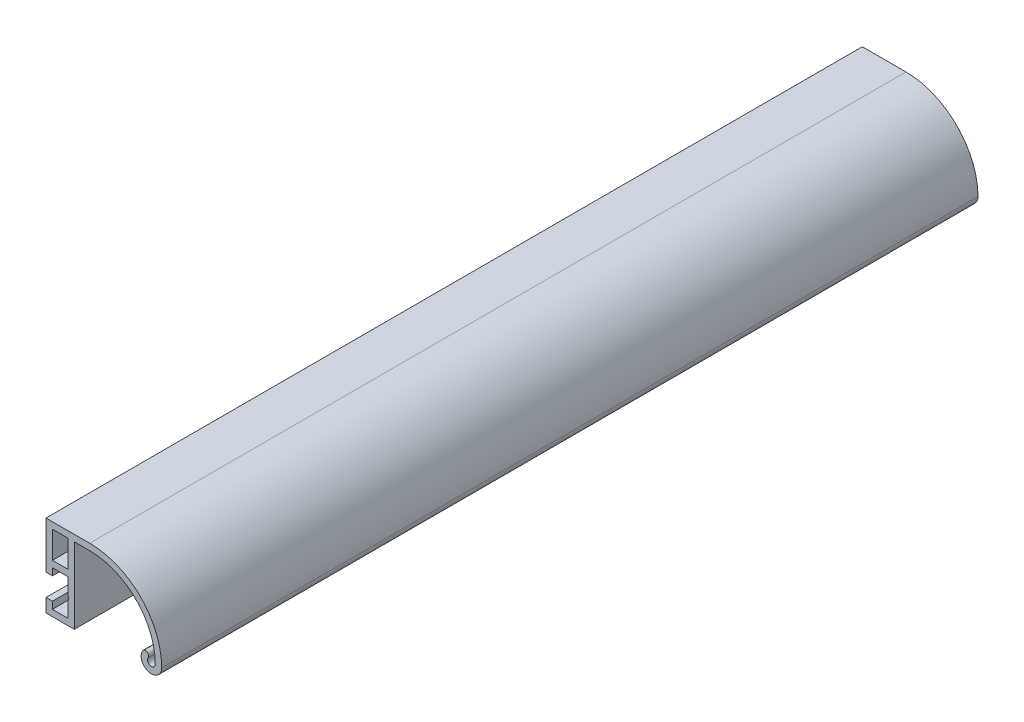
from build123d import *

# Parameters (mm, degrees)
BOSS_EXTRUDE2_DEPTH      = 158.75
BOSS_EXTRUDE2_DEPTH_BACK = 158.75
SKETCH1_W                = 6
SKETCH1_H                = 10.499998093
SKETCH2_R                = 4
CUT_EXTRUDE1_DEPTH       = 158.75


with BuildPart() as part:
    # Sketch1 → Boss-Extrude2 (new, two sides: drawn at the far end of the back side and taken through both)
    with BuildSketch(Plane.XY.offset(-BOSS_EXTRUDE2_DEPTH_BACK)):
        with BuildLine():
            Line((-22.499999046, -4.25), (-22.499999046, -9.5))
            Line((-22.499999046, -9.5), (-11.499999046, -9.5))
            Line((-11.499999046, -9.5), (-11.499999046, 19.999997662))
            Line((-11.499999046, 19.999997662), (-5.499999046, 19.999997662))
            ThreePointArc((-5.499999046, 19.999997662), (12.531222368, 12.531221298), (19.999999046, -5.499999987))
            ThreePointArc((19.999999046, -5.499999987), (18.074423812, -6.93836316), (17.241482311, -4.683826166))
            ThreePointArc((17.241482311, -4.683826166), (16.872864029, -2.954918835), (15.143956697, -3.323537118))
            ThreePointArc((15.143956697, -3.323537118), (17.365133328, -9.335633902), (22.499999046, -5.5))
            ThreePointArc((22.499999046, -5.5), (14.298989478, 14.298988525), (-5.499999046, 22.499998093))
            Line((-5.499999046, 22.499998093), (-22.499999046, 22.499998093))
            Line((-22.499999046, 22.499998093), (-22.499999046, 4.25))
            Line((-22.499999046, 4.25), (-19.999999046, 4.25))
            Line((-19.999999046, 4.25), (-19.999999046, 7))
            Line((-19.999999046, 7), (-13.999999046, 7))
            Line((-13.999999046, 7), (-13.999999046, 0.5))
            Line((-13.999999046, 0.5), (-13.499999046, 0))
            Line((-13.499999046, 0), (-13.999999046, -0.5))
            Line((-13.999999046, -0.5), (-13.999999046, -7))
            Line((-13.999999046, -7), (-19.999999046, -7))
            Line((-19.999999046, -7), (-19.999999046, -4.25))
            Line((-19.999999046, -4.25), (-22.499999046, -4.25))
        make_face()
        with Locations((-16.999999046, 14.749999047)):
            Rectangle(SKETCH1_W, SKETCH1_H, mode=Mode.SUBTRACT)
    extrude(amount=BOSS_EXTRUDE2_DEPTH + BOSS_EXTRUDE2_DEPTH_BACK)

    # Sketch2 → Cut-Extrude1 (cut)
    with BuildSketch(Plane(origin=(-11.499999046, 0, 0), x_dir=(0, 0, -1), z_dir=(1, 0, 0))):
        with Locations((-120.65, 0)):
            Circle(SKETCH2_R)
        with Locations((120.65, 0)):
            Circle(SKETCH2_R)
    extrude(amount=-CUT_EXTRUDE1_DEPTH, mode=Mode.SUBTRACT)


solid = part.part
